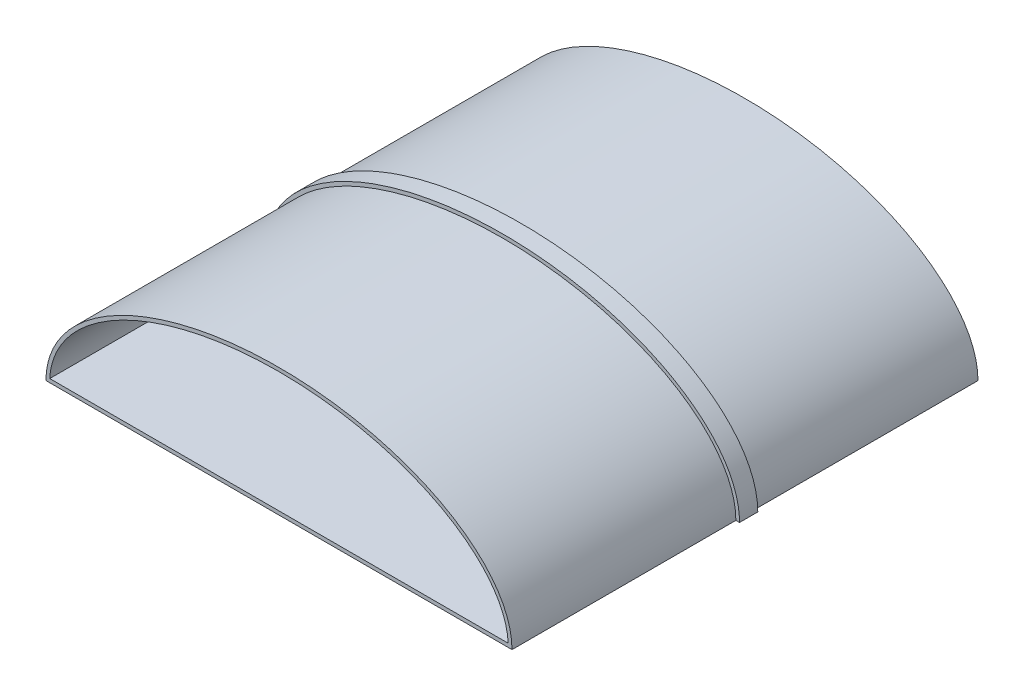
ISO-10303-21;
HEADER;
FILE_DESCRIPTION(('STEP AP214'),'2;1');
FILE_NAME('part.step','',(''),(''),'','','');
FILE_SCHEMA(('AUTOMOTIVE_DESIGN { 1 0 10303 214 1 1 1 1 }'));
ENDSEC;
DATA;
#1=APPLICATION_CONTEXT('core data for automotive mechanical design processes');
#2=APPLICATION_PROTOCOL_DEFINITION('international standard','automotive_design',2000,#1);
#3=PRODUCT_CONTEXT('',#1,'mechanical');
#4=PRODUCT('Part','Part','',(#3));
#5=PRODUCT_RELATED_PRODUCT_CATEGORY('part','',(#4));
#6=PRODUCT_DEFINITION_FORMATION('','',#4);
#7=PRODUCT_DEFINITION_CONTEXT('part definition',#1,'design');
#8=PRODUCT_DEFINITION('design','',#6,#7);
#9=PRODUCT_DEFINITION_SHAPE('','',#8);
#10=(LENGTH_UNIT() NAMED_UNIT(*) SI_UNIT(.MILLI.,.METRE.));
#11=(NAMED_UNIT(*) PLANE_ANGLE_UNIT() SI_UNIT($,.RADIAN.));
#12=(NAMED_UNIT(*) SI_UNIT($,.STERADIAN.) SOLID_ANGLE_UNIT());
#13=UNCERTAINTY_MEASURE_WITH_UNIT(LENGTH_MEASURE(1.E-05),#10,'distance_accuracy_value','');
#14=(GEOMETRIC_REPRESENTATION_CONTEXT(3) GLOBAL_UNCERTAINTY_ASSIGNED_CONTEXT((#13)) GLOBAL_UNIT_ASSIGNED_CONTEXT((#10,
#11,#12)) REPRESENTATION_CONTEXT('',''));
#15=CARTESIAN_POINT('',(0.,0.,0.));
#16=DIRECTION('',(0.,0.,1.));
#17=DIRECTION('',(1.,0.,0.));
#18=AXIS2_PLACEMENT_3D('',#15,#16,#17);
#19=CARTESIAN_POINT('',(127.5,0.,255.));
#20=DIRECTION('',(0.,0.,1.));
#21=DIRECTION('',(-1.,0.,0.));
#22=AXIS2_PLACEMENT_3D('',#19,#20,#21);
#23=ELLIPSE('',#22,127.5,70.);
#24=DIRECTION('',(0.,0.,-1.));
#25=VECTOR('',#24,1.);
#26=SURFACE_OF_LINEAR_EXTRUSION('',#23,#25);
#27=CARTESIAN_POINT('',(127.5,0.,132.5));
#28=DIRECTION('',(0.,0.,1.));
#29=DIRECTION('',(-1.,0.,0.));
#30=AXIS2_PLACEMENT_3D('',#27,#28,#29);
#31=ELLIPSE('',#30,127.5,70.);
#32=CARTESIAN_POINT('',(255.,0.,132.5));
#33=VERTEX_POINT('',#32);
#34=CARTESIAN_POINT('',(252.550123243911,13.6563225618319,132.5));
#35=VERTEX_POINT('',#34);
#36=EDGE_CURVE('E214',#33,#35,#31,.T.);
#37=ORIENTED_EDGE('',*,*,#36,.T.);
#38=CARTESIAN_POINT('',(127.5,0.,132.5));
#39=DIRECTION('',(0.,0.,1.));
#40=DIRECTION('',(-1.,0.,0.));
#41=AXIS2_PLACEMENT_3D('',#38,#39,#40);
#42=ELLIPSE('',#41,127.5,70.);
#43=CARTESIAN_POINT('',(127.500000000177,70.,132.5));
#44=VERTEX_POINT('',#43);
#45=EDGE_CURVE('E280',#44,#35,#42,.F.);
#46=ORIENTED_EDGE('',*,*,#45,.F.);
#47=CARTESIAN_POINT('',(127.5,0.,132.5));
#48=DIRECTION('',(0.,0.,1.));
#49=DIRECTION('',(-1.,0.,0.));
#50=AXIS2_PLACEMENT_3D('',#47,#48,#49);
#51=ELLIPSE('',#50,127.5,70.);
#52=CARTESIAN_POINT('',(37.3438853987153,49.4974746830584,132.5));
#53=VERTEX_POINT('',#52);
#54=EDGE_CURVE('E283',#53,#44,#51,.F.);
#55=ORIENTED_EDGE('',*,*,#54,.F.);
#56=CARTESIAN_POINT('',(127.5,0.,132.5));
#57=DIRECTION('',(0.,0.,1.));
#58=DIRECTION('',(-1.,0.,0.));
#59=AXIS2_PLACEMENT_3D('',#56,#57,#58);
#60=ELLIPSE('',#59,127.5,70.);
#61=CARTESIAN_POINT('',(2.44987674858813,13.656322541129,132.5));
#62=VERTEX_POINT('',#61);
#63=EDGE_CURVE('E285',#62,#53,#60,.F.);
#64=ORIENTED_EDGE('',*,*,#63,.F.);
#65=CARTESIAN_POINT('',(127.5,0.,132.5));
#66=DIRECTION('',(0.,0.,1.));
#67=DIRECTION('',(-1.,0.,0.));
#68=AXIS2_PLACEMENT_3D('',#65,#66,#67);
#69=ELLIPSE('',#68,127.5,70.);
#70=CARTESIAN_POINT('',(0.,0.,132.5));
#71=VERTEX_POINT('',#70);
#72=EDGE_CURVE('E287',#71,#62,#69,.F.);
#73=ORIENTED_EDGE('',*,*,#72,.F.);
#74=DIRECTION('',(0.,0.,-1.));
#75=VECTOR('',#74,1.);
#76=CARTESIAN_POINT('',(0.,0.,255.));
#77=LINE('',#76,#75);
#78=CARTESIAN_POINT('',(0.,0.,255.));
#79=VERTEX_POINT('',#78);
#80=EDGE_CURVE('E212',#79,#71,#77,.T.);
#81=ORIENTED_EDGE('',*,*,#80,.F.);
#82=CARTESIAN_POINT('',(255.,0.,255.));
#83=VERTEX_POINT('',#82);
#84=EDGE_CURVE('E438',#83,#79,#23,.T.);
#85=ORIENTED_EDGE('',*,*,#84,.F.);
#86=DIRECTION('',(0.,0.,-1.));
#87=VECTOR('',#86,1.);
#88=CARTESIAN_POINT('',(255.,0.,255.));
#89=LINE('',#88,#87);
#90=EDGE_CURVE('E461',#83,#33,#89,.T.);
#91=ORIENTED_EDGE('',*,*,#90,.T.);
#92=EDGE_LOOP('',(#37,#46,#55,#64,#73,#81,#85,#91));
#93=FACE_BOUND('',#92,.T.);
#94=ADVANCED_FACE('F39',(#93),#26,.F.);
#95=CARTESIAN_POINT('',(0.,0.,255.));
#96=DIRECTION('',(0.,1.,0.));
#97=DIRECTION('',(0.,0.,1.));
#98=AXIS2_PLACEMENT_3D('',#95,#96,#97);
#99=PLANE('',#98);
#100=DIRECTION('',(1.,0.,0.));
#101=VECTOR('',#100,1.);
#102=CARTESIAN_POINT('',(0.,0.,0.));
#103=LINE('',#102,#101);
#104=CARTESIAN_POINT('',(0.,0.,0.));
#105=VERTEX_POINT('',#104);
#106=CARTESIAN_POINT('',(255.,0.,0.));
#107=VERTEX_POINT('',#106);
#108=EDGE_CURVE('E444',#105,#107,#103,.T.);
#109=ORIENTED_EDGE('',*,*,#108,.T.);
#110=CARTESIAN_POINT('',(255.,0.,122.5));
#111=VERTEX_POINT('',#110);
#112=EDGE_CURVE('E447',#111,#107,#89,.T.);
#113=ORIENTED_EDGE('',*,*,#112,.F.);
#114=DIRECTION('',(-1.,0.,0.));
#115=VECTOR('',#114,1.);
#116=CARTESIAN_POINT('',(257.,0.,122.5));
#117=LINE('',#116,#115);
#118=CARTESIAN_POINT('',(257.,0.,122.5));
#119=VERTEX_POINT('',#118);
#120=EDGE_CURVE('E193',#119,#111,#117,.T.);
#121=ORIENTED_EDGE('',*,*,#120,.F.);
#122=DIRECTION('',(0.,0.,1.));
#123=VECTOR('',#122,1.);
#124=CARTESIAN_POINT('',(257.,0.,122.5));
#125=LINE('',#124,#123);
#126=CARTESIAN_POINT('',(257.,0.,132.5));
#127=VERTEX_POINT('',#126);
#128=EDGE_CURVE('E192',#119,#127,#125,.T.);
#129=ORIENTED_EDGE('',*,*,#128,.T.);
#130=DIRECTION('',(-1.,0.,0.));
#131=VECTOR('',#130,1.);
#132=CARTESIAN_POINT('',(257.,0.,132.5));
#133=LINE('',#132,#131);
#134=EDGE_CURVE('E203',#127,#33,#133,.T.);
#135=ORIENTED_EDGE('',*,*,#134,.T.);
#136=ORIENTED_EDGE('',*,*,#90,.F.);
#137=DIRECTION('',(1.,0.,0.));
#138=VECTOR('',#137,1.);
#139=CARTESIAN_POINT('',(0.,0.,255.));
#140=LINE('',#139,#138);
#141=EDGE_CURVE('E443',#79,#83,#140,.T.);
#142=ORIENTED_EDGE('',*,*,#141,.F.);
#143=ORIENTED_EDGE('',*,*,#80,.T.);
#144=DIRECTION('',(-1.,0.,0.));
#145=VECTOR('',#144,1.);
#146=CARTESIAN_POINT('',(0.,0.,132.5));
#147=LINE('',#146,#145);
#148=CARTESIAN_POINT('',(-2.,0.,132.5));
#149=VERTEX_POINT('',#148);
#150=EDGE_CURVE('E200',#71,#149,#147,.T.);
#151=ORIENTED_EDGE('',*,*,#150,.T.);
#152=DIRECTION('',(0.,0.,1.));
#153=VECTOR('',#152,1.);
#154=CARTESIAN_POINT('',(-2.,0.,122.5));
#155=LINE('',#154,#153);
#156=CARTESIAN_POINT('',(-2.,0.,122.5));
#157=VERTEX_POINT('',#156);
#158=EDGE_CURVE('E179',#157,#149,#155,.T.);
#159=ORIENTED_EDGE('',*,*,#158,.F.);
#160=DIRECTION('',(-1.,0.,0.));
#161=VECTOR('',#160,1.);
#162=CARTESIAN_POINT('',(0.,0.,122.5));
#163=LINE('',#162,#161);
#164=CARTESIAN_POINT('',(0.,0.,122.5));
#165=VERTEX_POINT('',#164);
#166=EDGE_CURVE('E537',#165,#157,#163,.T.);
#167=ORIENTED_EDGE('',*,*,#166,.F.);
#168=EDGE_CURVE('E464',#165,#105,#77,.T.);
#169=ORIENTED_EDGE('',*,*,#168,.T.);
#170=EDGE_LOOP('',(#109,#113,#121,#129,#135,#136,#142,#143,#151,#159,#167,#169));
#171=FACE_BOUND('',#170,.T.);
#172=DIRECTION('',(0.,0.,-1.));
#173=VECTOR('',#172,1.);
#174=CARTESIAN_POINT('',(30.,0.,225.));
#175=LINE('',#174,#173);
#176=CARTESIAN_POINT('',(30.,0.,225.));
#177=VERTEX_POINT('',#176);
#178=CARTESIAN_POINT('',(30.,0.,30.));
#179=VERTEX_POINT('',#178);
#180=EDGE_CURVE('E384',#177,#179,#175,.T.);
#181=ORIENTED_EDGE('',*,*,#180,.F.);
#182=DIRECTION('',(-1.,0.,0.));
#183=VECTOR('',#182,1.);
#184=CARTESIAN_POINT('',(225.,0.,225.));
#185=LINE('',#184,#183);
#186=CARTESIAN_POINT('',(225.,0.,225.));
#187=VERTEX_POINT('',#186);
#188=EDGE_CURVE('E399',#187,#177,#185,.T.);
#189=ORIENTED_EDGE('',*,*,#188,.F.);
#190=DIRECTION('',(0.,0.,1.));
#191=VECTOR('',#190,1.);
#192=CARTESIAN_POINT('',(225.,0.,30.));
#193=LINE('',#192,#191);
#194=CARTESIAN_POINT('',(225.,0.,30.));
#195=VERTEX_POINT('',#194);
#196=EDGE_CURVE('E416',#195,#187,#193,.T.);
#197=ORIENTED_EDGE('',*,*,#196,.F.);
#198=DIRECTION('',(1.,0.,0.));
#199=VECTOR('',#198,1.);
#200=CARTESIAN_POINT('',(30.,0.,30.));
#201=LINE('',#200,#199);
#202=EDGE_CURVE('E412',#179,#195,#201,.T.);
#203=ORIENTED_EDGE('',*,*,#202,.F.);
#204=EDGE_LOOP('',(#181,#189,#197,#203));
#205=FACE_BOUND('',#204,.T.);
#206=ADVANCED_FACE('F209',(#171,#205),#99,.F.);
#207=CARTESIAN_POINT('',(127.5,0.,122.5));
#208=DIRECTION('',(0.,0.,-1.));
#209=DIRECTION('',(-1.,0.,0.));
#210=AXIS2_PLACEMENT_3D('',#207,#208,#209);
#211=ELLIPSE('',#210,127.5,70.);
#212=CARTESIAN_POINT('',(127.500000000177,70.,122.5));
#213=VERTEX_POINT('',#212);
#214=CARTESIAN_POINT('',(252.550123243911,13.6563225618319,122.5));
#215=VERTEX_POINT('',#214);
#216=EDGE_CURVE('E11',#213,#215,#211,.T.);
#217=ORIENTED_EDGE('',*,*,#216,.T.);
#218=CARTESIAN_POINT('',(127.5,0.,122.5));
#219=DIRECTION('',(0.,0.,-1.));
#220=DIRECTION('',(-1.,0.,0.));
#221=AXIS2_PLACEMENT_3D('',#218,#219,#220);
#222=ELLIPSE('',#221,127.5,70.);
#223=EDGE_CURVE('E540',#111,#215,#222,.F.);
#224=ORIENTED_EDGE('',*,*,#223,.F.);
#225=ORIENTED_EDGE('',*,*,#112,.T.);
#226=CARTESIAN_POINT('',(127.5,0.,0.));
#227=DIRECTION('',(0.,0.,1.));
#228=DIRECTION('',(-1.,0.,0.));
#229=AXIS2_PLACEMENT_3D('',#226,#227,#228);
#230=ELLIPSE('',#229,127.5,70.);
#231=EDGE_CURVE('E437',#107,#105,#230,.T.);
#232=ORIENTED_EDGE('',*,*,#231,.T.);
#233=ORIENTED_EDGE('',*,*,#168,.F.);
#234=CARTESIAN_POINT('',(127.5,0.,122.5));
#235=DIRECTION('',(0.,0.,-1.));
#236=DIRECTION('',(-1.,0.,0.));
#237=AXIS2_PLACEMENT_3D('',#234,#235,#236);
#238=ELLIPSE('',#237,127.5,70.);
#239=CARTESIAN_POINT('',(2.449876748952,13.6563225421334,122.5));
#240=VERTEX_POINT('',#239);
#241=EDGE_CURVE('E309',#165,#240,#238,.T.);
#242=ORIENTED_EDGE('',*,*,#241,.T.);
#243=CARTESIAN_POINT('',(127.5,0.,122.5));
#244=DIRECTION('',(0.,0.,-1.));
#245=DIRECTION('',(-1.,0.,0.));
#246=AXIS2_PLACEMENT_3D('',#243,#244,#245);
#247=ELLIPSE('',#246,127.5,70.);
#248=CARTESIAN_POINT('',(37.3438853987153,49.4974746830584,122.5));
#249=VERTEX_POINT('',#248);
#250=EDGE_CURVE('E307',#240,#249,#247,.T.);
#251=ORIENTED_EDGE('',*,*,#250,.T.);
#252=CARTESIAN_POINT('',(127.5,0.,122.5));
#253=DIRECTION('',(0.,0.,-1.));
#254=DIRECTION('',(-1.,0.,0.));
#255=AXIS2_PLACEMENT_3D('',#252,#253,#254);
#256=ELLIPSE('',#255,127.5,70.);
#257=EDGE_CURVE('E52',#249,#213,#256,.T.);
#258=ORIENTED_EDGE('',*,*,#257,.T.);
#259=EDGE_LOOP('',(#217,#224,#225,#232,#233,#242,#251,#258));
#260=FACE_BOUND('',#259,.T.);
#261=ADVANCED_FACE('F41',(#260),#26,.F.);
#262=CARTESIAN_POINT('',(127.5,0.,255.));
#263=DIRECTION('',(0.,0.,1.));
#264=DIRECTION('',(1.,0.,0.));
#265=AXIS2_PLACEMENT_3D('',#262,#263,#264);
#266=PLANE('',#265);
#267=CARTESIAN_POINT('',(252.94509137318,2.00000000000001,255.));
#268=CARTESIAN_POINT('',(252.766662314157,5.24891875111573,255.));
#269=CARTESIAN_POINT('',(252.16192186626,8.39524352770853,255.));
#270=CARTESIAN_POINT('',(250.94442723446,12.2170705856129,255.));
#271=CARTESIAN_POINT('',(250.677682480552,12.975841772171,255.));
#272=CARTESIAN_POINT('',(250.098875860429,14.4824783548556,255.));
#273=CARTESIAN_POINT('',(249.785732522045,15.2326564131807,255.));
#274=CARTESIAN_POINT('',(248.788722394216,17.4478719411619,255.));
#275=CARTESIAN_POINT('',(248.049233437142,18.8756767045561,255.));
#276=CARTESIAN_POINT('',(245.635710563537,23.0313256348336,255.));
#277=CARTESIAN_POINT('',(243.768182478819,25.6324274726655,255.));
#278=CARTESIAN_POINT('',(241.172981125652,28.7129815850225,255.));
#279=CARTESIAN_POINT('',(240.639900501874,29.3214080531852,255.));
#280=CARTESIAN_POINT('',(239.552603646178,30.5172192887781,255.));
#281=CARTESIAN_POINT('',(238.999610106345,31.1033481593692,255.));
#282=CARTESIAN_POINT('',(237.314559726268,32.828881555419,255.));
#283=CARTESIAN_POINT('',(236.156504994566,33.9355234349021,255.));
#284=CARTESIAN_POINT('',(232.590839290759,37.1401385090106,255.));
#285=CARTESIAN_POINT('',(230.092357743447,39.1235962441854,255.));
#286=CARTESIAN_POINT('',(224.897498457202,42.8411221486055,255.));
#287=CARTESIAN_POINT('',(222.199411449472,44.5755609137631,255.));
#288=CARTESIAN_POINT('',(216.637943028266,47.8258852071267,255.));
#289=CARTESIAN_POINT('',(213.808265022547,49.3223559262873,255.));
#290=CARTESIAN_POINT('',(208.067277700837,52.1006583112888,255.));
#291=CARTESIAN_POINT('',(205.155867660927,53.3822251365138,255.));
#292=CARTESIAN_POINT('',(196.314782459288,56.9459638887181,255.));
#293=CARTESIAN_POINT('',(190.279228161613,58.9497402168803,255.));
#294=CARTESIAN_POINT('',(182.58762224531,61.0675142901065,255.));
#295=CARTESIAN_POINT('',(181.041857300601,61.4714966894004,255.));
#296=CARTESIAN_POINT('',(177.935881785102,62.2414785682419,255.));
#297=CARTESIAN_POINT('',(176.373813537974,62.6078796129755,255.));
#298=CARTESIAN_POINT('',(171.680855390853,63.6483582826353,255.));
#299=CARTESIAN_POINT('',(168.547945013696,64.2630410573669,255.));
#300=CARTESIAN_POINT('',(159.13735887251,65.8879247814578,255.));
#301=CARTESIAN_POINT('',(152.847901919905,66.6803258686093,255.));
#302=CARTESIAN_POINT('',(140.240328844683,67.7353034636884,255.));
#303=CARTESIAN_POINT('',(133.92219254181,67.9975068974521,255.));
#304=CARTESIAN_POINT('',(121.257821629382,68.002457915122,255.));
#305=CARTESIAN_POINT('',(114.911591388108,67.7452862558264,255.));
#306=CARTESIAN_POINT('',(106.960385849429,67.0833313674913,255.));
#307=CARTESIAN_POINT('',(105.369218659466,66.9338198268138,255.));
#308=CARTESIAN_POINT('',(102.184988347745,66.5997464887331,255.));
#309=CARTESIAN_POINT('',(100.593373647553,66.4152966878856,255.));
#310=CARTESIAN_POINT('',(95.8361463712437,65.8109134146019,255.));
#311=CARTESIAN_POINT('',(92.681992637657,65.3394105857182,255.));
#312=CARTESIAN_POINT('',(83.2731348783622,63.7127889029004,255.));
#313=CARTESIAN_POINT('',(77.0715445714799,62.3474947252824,255.));
#314=CARTESIAN_POINT('',(64.8287395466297,58.9822870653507,255.));
#315=CARTESIAN_POINT('',(58.7870312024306,56.9843269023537,255.));
#316=CARTESIAN_POINT('',(51.359523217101,53.9937157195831,255.));
#317=CARTESIAN_POINT('',(49.8782183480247,53.3696775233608,255.));
#318=CARTESIAN_POINT('',(46.9402248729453,52.0726044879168,255.));
#319=CARTESIAN_POINT('',(45.484806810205,51.4002253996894,255.));
#320=CARTESIAN_POINT('',(41.1617259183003,49.3072808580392,255.));
#321=CARTESIAN_POINT('',(38.3369897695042,47.8113411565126,255.));
#322=CARTESIAN_POINT('',(32.8200164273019,44.586809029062,255.));
#323=CARTESIAN_POINT('',(30.1275870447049,42.8585540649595,255.));
#324=CARTESIAN_POINT('',(26.209096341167,40.055196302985,255.));
#325=CARTESIAN_POINT('',(24.9208400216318,39.0834282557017,255.));
#326=CARTESIAN_POINT('',(22.4129648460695,37.0797449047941,255.));
#327=CARTESIAN_POINT('',(21.1908955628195,36.0462708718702,255.));
#328=CARTESIAN_POINT('',(17.6292216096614,32.8420888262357,255.));
#329=CARTESIAN_POINT('',(15.3928624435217,30.5688997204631,255.));
#330=CARTESIAN_POINT('',(12.2989147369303,26.9004543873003,255.));
#331=CARTESIAN_POINT('',(11.3112987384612,25.6342629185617,255.));
#332=CARTESIAN_POINT('',(9.90581977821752,23.6595929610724,255.));
#333=CARTESIAN_POINT('',(9.45176010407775,22.9910997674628,255.));
#334=CARTESIAN_POINT('',(8.57842601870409,21.6393141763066,255.));
#335=CARTESIAN_POINT('',(8.15844409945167,20.955037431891,255.));
#336=CARTESIAN_POINT('',(6.14578655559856,17.489811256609,255.));
#337=CARTESIAN_POINT('',(4.81160458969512,14.57897380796,255.));
#338=CARTESIAN_POINT('',(3.57844440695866,10.7220654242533,255.));
#339=CARTESIAN_POINT('',(3.35507503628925,9.943406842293,255.));
#340=CARTESIAN_POINT('',(2.95850531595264,8.37966181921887,255.));
#341=CARTESIAN_POINT('',(2.78488553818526,7.59328459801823,255.));
#342=CARTESIAN_POINT('',(2.33976516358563,5.22032034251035,255.));
#343=CARTESIAN_POINT('',(2.14387409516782,3.61992435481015,255.));
#344=CARTESIAN_POINT('',(2.05490862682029,2.0000000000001,255.));
#345=B_SPLINE_CURVE_WITH_KNOTS('',3,(#267,#268,#269,#270,#271,#272,#273,#274,#275,#276,#277,
#278,#279,#280,#281,#282,#283,#284,#285,#286,#287,#288,#289,#290,#291,#292,#293,#294,#295,#296,
#297,#298,#299,#300,#301,#302,#303,#304,#305,#306,#307,#308,#309,#310,#311,#312,#313,#314,#315,
#316,#317,#318,#319,#320,#321,#322,#323,#324,#325,#326,#327,#328,#329,#330,#331,#332,#333,#334,
#335,#336,#337,#338,#339,#340,#341,#342,#343,#344),.UNSPECIFIED.,.F.,.F.,(4,2,2,2,2,2,2,2,2,2,2,
2,2,2,2,2,2,2,2,2,2,2,2,2,2,2,2,2,2,2,2,2,2,2,2,2,2,2,4),(0.,0.0312499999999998,
0.0390624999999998,0.0468749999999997,0.0624999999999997,0.0937499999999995,0.101562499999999,
0.109374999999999,0.124999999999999,0.156249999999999,0.187499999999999,0.218749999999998,
0.249999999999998,0.312499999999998,0.328124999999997,0.343749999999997,0.374999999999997,
0.437499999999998,0.499999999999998,0.562499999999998,0.578124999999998,0.593749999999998,
0.624999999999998,0.687499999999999,0.749999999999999,0.765624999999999,0.781249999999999,
0.812499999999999,0.843749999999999,0.859374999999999,0.874999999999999,0.906249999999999,
0.921874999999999,0.929687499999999,0.937499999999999,0.96875,0.9765625,0.984375,1.),.UNSPECIFIED.);
#346=CARTESIAN_POINT('',(252.94509137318,2.00000000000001,255.));
#347=VERTEX_POINT('',#346);
#348=CARTESIAN_POINT('',(2.05490862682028,2.00000000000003,255.));
#349=VERTEX_POINT('',#348);
#350=EDGE_CURVE('E345',#347,#349,#345,.T.);
#351=ORIENTED_EDGE('',*,*,#350,.F.);
#352=DIRECTION('',(1.,0.,0.));
#353=VECTOR('',#352,1.);
#354=CARTESIAN_POINT('',(2.05490862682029,2.00000000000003,255.));
#355=LINE('',#354,#353);
#356=EDGE_CURVE('E335',#349,#347,#355,.T.);
#357=ORIENTED_EDGE('',*,*,#356,.F.);
#358=EDGE_LOOP('',(#351,#357));
#359=FACE_BOUND('',#358,.T.);
#360=ORIENTED_EDGE('',*,*,#84,.T.);
#361=ORIENTED_EDGE('',*,*,#141,.T.);
#362=EDGE_LOOP('',(#360,#361));
#363=FACE_BOUND('',#362,.T.);
#364=ADVANCED_FACE('F475',(#359,#363),#266,.T.);
#365=CARTESIAN_POINT('',(127.5,0.,0.));
#366=DIRECTION('',(0.,0.,1.));
#367=DIRECTION('',(1.,0.,0.));
#368=AXIS2_PLACEMENT_3D('',#365,#366,#367);
#369=PLANE('',#368);
#370=DIRECTION('',(1.,0.,0.));
#371=VECTOR('',#370,1.);
#372=CARTESIAN_POINT('',(2.05490862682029,2.00000000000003,0.));
#373=LINE('',#372,#371);
#374=CARTESIAN_POINT('',(2.05490862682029,2.00000000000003,0.));
#375=VERTEX_POINT('',#374);
#376=CARTESIAN_POINT('',(252.94509137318,2.00000000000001,0.));
#377=VERTEX_POINT('',#376);
#378=EDGE_CURVE('E503',#375,#377,#373,.T.);
#379=ORIENTED_EDGE('',*,*,#378,.T.);
#380=CARTESIAN_POINT('',(2.05490862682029,2.0000000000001,0.));
#381=CARTESIAN_POINT('',(2.14387409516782,3.61992435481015,0.));
#382=CARTESIAN_POINT('',(2.33976516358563,5.22032034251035,0.));
#383=CARTESIAN_POINT('',(2.78488553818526,7.59328459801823,0.));
#384=CARTESIAN_POINT('',(2.95850531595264,8.37966181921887,0.));
#385=CARTESIAN_POINT('',(3.35507503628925,9.943406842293,0.));
#386=CARTESIAN_POINT('',(3.57844440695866,10.7220654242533,0.));
#387=CARTESIAN_POINT('',(4.81160458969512,14.57897380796,0.));
#388=CARTESIAN_POINT('',(6.14578655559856,17.489811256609,0.));
#389=CARTESIAN_POINT('',(8.15844409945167,20.955037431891,0.));
#390=CARTESIAN_POINT('',(8.57842601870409,21.6393141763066,0.));
#391=CARTESIAN_POINT('',(9.45176010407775,22.9910997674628,0.));
#392=CARTESIAN_POINT('',(9.90581977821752,23.6595929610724,0.));
#393=CARTESIAN_POINT('',(11.3112987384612,25.6342629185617,0.));
#394=CARTESIAN_POINT('',(12.2989147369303,26.9004543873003,0.));
#395=CARTESIAN_POINT('',(15.3928624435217,30.5688997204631,0.));
#396=CARTESIAN_POINT('',(17.6292216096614,32.8420888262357,0.));
#397=CARTESIAN_POINT('',(21.1908955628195,36.0462708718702,0.));
#398=CARTESIAN_POINT('',(22.4129648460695,37.0797449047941,0.));
#399=CARTESIAN_POINT('',(24.9208400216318,39.0834282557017,0.));
#400=CARTESIAN_POINT('',(26.209096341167,40.055196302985,0.));
#401=CARTESIAN_POINT('',(30.1275870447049,42.8585540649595,0.));
#402=CARTESIAN_POINT('',(32.8200164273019,44.586809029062,0.));
#403=CARTESIAN_POINT('',(38.3369897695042,47.8113411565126,0.));
#404=CARTESIAN_POINT('',(41.1617259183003,49.3072808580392,0.));
#405=CARTESIAN_POINT('',(45.484806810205,51.4002253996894,0.));
#406=CARTESIAN_POINT('',(46.9402248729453,52.0726044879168,0.));
#407=CARTESIAN_POINT('',(49.8782183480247,53.3696775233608,0.));
#408=CARTESIAN_POINT('',(51.359523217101,53.9937157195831,0.));
#409=CARTESIAN_POINT('',(58.7870312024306,56.9843269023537,0.));
#410=CARTESIAN_POINT('',(64.8287395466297,58.9822870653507,0.));
#411=CARTESIAN_POINT('',(77.0715445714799,62.3474947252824,0.));
#412=CARTESIAN_POINT('',(83.2731348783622,63.7127889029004,0.));
#413=CARTESIAN_POINT('',(92.681992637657,65.3394105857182,0.));
#414=CARTESIAN_POINT('',(95.8361463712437,65.8109134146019,0.));
#415=CARTESIAN_POINT('',(100.593373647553,66.4152966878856,0.));
#416=CARTESIAN_POINT('',(102.184988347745,66.5997464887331,0.));
#417=CARTESIAN_POINT('',(105.369218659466,66.9338198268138,0.));
#418=CARTESIAN_POINT('',(106.960385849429,67.0833313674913,0.));
#419=CARTESIAN_POINT('',(114.911591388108,67.7452862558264,0.));
#420=CARTESIAN_POINT('',(121.257821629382,68.002457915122,0.));
#421=CARTESIAN_POINT('',(133.92219254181,67.9975068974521,0.));
#422=CARTESIAN_POINT('',(140.240328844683,67.7353034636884,0.));
#423=CARTESIAN_POINT('',(152.847901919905,66.6803258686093,0.));
#424=CARTESIAN_POINT('',(159.13735887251,65.8879247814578,0.));
#425=CARTESIAN_POINT('',(168.547945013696,64.2630410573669,0.));
#426=CARTESIAN_POINT('',(171.680855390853,63.6483582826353,0.));
#427=CARTESIAN_POINT('',(176.373813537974,62.6078796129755,0.));
#428=CARTESIAN_POINT('',(177.935881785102,62.2414785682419,0.));
#429=CARTESIAN_POINT('',(181.041857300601,61.4714966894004,0.));
#430=CARTESIAN_POINT('',(182.58762224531,61.0675142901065,0.));
#431=CARTESIAN_POINT('',(190.279228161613,58.9497402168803,0.));
#432=CARTESIAN_POINT('',(196.314782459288,56.9459638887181,0.));
#433=CARTESIAN_POINT('',(205.155867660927,53.3822251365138,0.));
#434=CARTESIAN_POINT('',(208.067277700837,52.1006583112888,0.));
#435=CARTESIAN_POINT('',(213.808265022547,49.3223559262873,0.));
#436=CARTESIAN_POINT('',(216.637943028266,47.8258852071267,0.));
#437=CARTESIAN_POINT('',(222.199411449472,44.5755609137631,0.));
#438=CARTESIAN_POINT('',(224.897498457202,42.8411221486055,0.));
#439=CARTESIAN_POINT('',(230.092357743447,39.1235962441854,0.));
#440=CARTESIAN_POINT('',(232.590839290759,37.1401385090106,0.));
#441=CARTESIAN_POINT('',(236.156504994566,33.9355234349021,0.));
#442=CARTESIAN_POINT('',(237.314559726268,32.828881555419,0.));
#443=CARTESIAN_POINT('',(238.999610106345,31.1033481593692,0.));
#444=CARTESIAN_POINT('',(239.552603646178,30.5172192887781,0.));
#445=CARTESIAN_POINT('',(240.639900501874,29.3214080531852,0.));
#446=CARTESIAN_POINT('',(241.172981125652,28.7129815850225,0.));
#447=CARTESIAN_POINT('',(243.768182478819,25.6324274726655,0.));
#448=CARTESIAN_POINT('',(245.635710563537,23.0313256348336,0.));
#449=CARTESIAN_POINT('',(248.049233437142,18.8756767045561,0.));
#450=CARTESIAN_POINT('',(248.788722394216,17.4478719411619,0.));
#451=CARTESIAN_POINT('',(249.785732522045,15.2326564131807,0.));
#452=CARTESIAN_POINT('',(250.098875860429,14.4824783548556,0.));
#453=CARTESIAN_POINT('',(250.677682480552,12.975841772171,0.));
#454=CARTESIAN_POINT('',(250.94442723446,12.2170705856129,0.));
#455=CARTESIAN_POINT('',(252.16192186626,8.39524352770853,0.));
#456=CARTESIAN_POINT('',(252.766662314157,5.24891875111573,0.));
#457=CARTESIAN_POINT('',(252.94509137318,2.00000000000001,0.));
#458=B_SPLINE_CURVE_WITH_KNOTS('',3,(#380,#381,#382,#383,#384,#385,#386,#387,#388,#389,#390,
#391,#392,#393,#394,#395,#396,#397,#398,#399,#400,#401,#402,#403,#404,#405,#406,#407,#408,#409,
#410,#411,#412,#413,#414,#415,#416,#417,#418,#419,#420,#421,#422,#423,#424,#425,#426,#427,#428,
#429,#430,#431,#432,#433,#434,#435,#436,#437,#438,#439,#440,#441,#442,#443,#444,#445,#446,#447,
#448,#449,#450,#451,#452,#453,#454,#455,#456,#457),.UNSPECIFIED.,.F.,.F.,(4,2,2,2,2,2,2,2,2,2,2,
2,2,2,2,2,2,2,2,2,2,2,2,2,2,2,2,2,2,2,2,2,2,2,2,2,2,2,4),(0.,0.0156250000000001,
0.0234375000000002,0.0312500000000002,0.0625000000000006,0.0703125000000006,0.0781250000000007,
0.0937500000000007,0.125000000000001,0.140625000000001,0.156250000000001,0.187500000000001,
0.218750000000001,0.234375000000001,0.250000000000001,0.312500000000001,0.375000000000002,
0.406250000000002,0.421875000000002,0.437500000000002,0.500000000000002,0.562500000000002,
0.625000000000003,0.656250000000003,0.671875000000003,0.687500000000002,0.750000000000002,
0.781250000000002,0.812500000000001,0.843750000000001,0.875000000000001,0.890625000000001,
0.898437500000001,0.906250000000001,0.9375,0.953125,0.9609375,0.96875,1.),.UNSPECIFIED.);
#459=EDGE_CURVE('E344',#377,#375,#458,.F.);
#460=ORIENTED_EDGE('',*,*,#459,.T.);
#461=EDGE_LOOP('',(#379,#460));
#462=FACE_BOUND('',#461,.T.);
#463=ORIENTED_EDGE('',*,*,#231,.F.);
#464=ORIENTED_EDGE('',*,*,#108,.F.);
#465=EDGE_LOOP('',(#463,#464));
#466=FACE_BOUND('',#465,.T.);
#467=ADVANCED_FACE('F485',(#462,#466),#369,.F.);
#468=CARTESIAN_POINT('',(30.,-10.,225.));
#469=DIRECTION('',(1.,0.,0.));
#470=DIRECTION('',(0.,0.,-1.));
#471=AXIS2_PLACEMENT_3D('',#468,#469,#470);
#472=PLANE('',#471);
#473=ORIENTED_EDGE('',*,*,#180,.T.);
#474=DIRECTION('',(0.,1.,0.));
#475=VECTOR('',#474,1.);
#476=CARTESIAN_POINT('',(30.,-10.,30.));
#477=LINE('',#476,#475);
#478=CARTESIAN_POINT('',(30.,-10.,30.));
#479=VERTEX_POINT('',#478);
#480=EDGE_CURVE('E434',#479,#179,#477,.T.);
#481=ORIENTED_EDGE('',*,*,#480,.F.);
#482=DIRECTION('',(0.,0.,-1.));
#483=VECTOR('',#482,1.);
#484=CARTESIAN_POINT('',(30.,-10.,225.));
#485=LINE('',#484,#483);
#486=CARTESIAN_POINT('',(30.,-10.,225.));
#487=VERTEX_POINT('',#486);
#488=EDGE_CURVE('E394',#487,#479,#485,.T.);
#489=ORIENTED_EDGE('',*,*,#488,.F.);
#490=DIRECTION('',(0.,1.,0.));
#491=VECTOR('',#490,1.);
#492=CARTESIAN_POINT('',(30.,-10.,225.));
#493=LINE('',#492,#491);
#494=EDGE_CURVE('E408',#487,#177,#493,.T.);
#495=ORIENTED_EDGE('',*,*,#494,.T.);
#496=EDGE_LOOP('',(#473,#481,#489,#495));
#497=FACE_BOUND('',#496,.T.);
#498=ADVANCED_FACE('F487',(#497),#472,.F.);
#499=CARTESIAN_POINT('',(30.,-10.,30.));
#500=DIRECTION('',(0.,0.,1.));
#501=DIRECTION('',(1.,0.,0.));
#502=AXIS2_PLACEMENT_3D('',#499,#500,#501);
#503=PLANE('',#502);
#504=ORIENTED_EDGE('',*,*,#202,.T.);
#505=DIRECTION('',(0.,1.,0.));
#506=VECTOR('',#505,1.);
#507=CARTESIAN_POINT('',(225.,-10.,30.));
#508=LINE('',#507,#506);
#509=CARTESIAN_POINT('',(225.,-10.,30.));
#510=VERTEX_POINT('',#509);
#511=EDGE_CURVE('E430',#510,#195,#508,.T.);
#512=ORIENTED_EDGE('',*,*,#511,.F.);
#513=DIRECTION('',(1.,0.,0.));
#514=VECTOR('',#513,1.);
#515=CARTESIAN_POINT('',(30.,-10.,30.));
#516=LINE('',#515,#514);
#517=EDGE_CURVE('E398',#479,#510,#516,.T.);
#518=ORIENTED_EDGE('',*,*,#517,.F.);
#519=ORIENTED_EDGE('',*,*,#480,.T.);
#520=EDGE_LOOP('',(#504,#512,#518,#519));
#521=FACE_BOUND('',#520,.T.);
#522=ADVANCED_FACE('F665',(#521),#503,.F.);
#523=CARTESIAN_POINT('',(225.,-10.,30.));
#524=DIRECTION('',(-1.,0.,0.));
#525=DIRECTION('',(0.,0.,1.));
#526=AXIS2_PLACEMENT_3D('',#523,#524,#525);
#527=PLANE('',#526);
#528=ORIENTED_EDGE('',*,*,#196,.T.);
#529=DIRECTION('',(0.,1.,0.));
#530=VECTOR('',#529,1.);
#531=CARTESIAN_POINT('',(225.,-10.,225.));
#532=LINE('',#531,#530);
#533=CARTESIAN_POINT('',(225.,-10.,225.));
#534=VERTEX_POINT('',#533);
#535=EDGE_CURVE('E426',#534,#187,#532,.T.);
#536=ORIENTED_EDGE('',*,*,#535,.F.);
#537=DIRECTION('',(0.,0.,1.));
#538=VECTOR('',#537,1.);
#539=CARTESIAN_POINT('',(225.,-10.,30.));
#540=LINE('',#539,#538);
#541=EDGE_CURVE('E402',#510,#534,#540,.T.);
#542=ORIENTED_EDGE('',*,*,#541,.F.);
#543=ORIENTED_EDGE('',*,*,#511,.T.);
#544=EDGE_LOOP('',(#528,#536,#542,#543));
#545=FACE_BOUND('',#544,.T.);
#546=ADVANCED_FACE('F672',(#545),#527,.F.);
#547=CARTESIAN_POINT('',(225.,-10.,225.));
#548=DIRECTION('',(0.,0.,-1.));
#549=DIRECTION('',(-1.,0.,0.));
#550=AXIS2_PLACEMENT_3D('',#547,#548,#549);
#551=PLANE('',#550);
#552=ORIENTED_EDGE('',*,*,#188,.T.);
#553=ORIENTED_EDGE('',*,*,#494,.F.);
#554=DIRECTION('',(-1.,0.,0.));
#555=VECTOR('',#554,1.);
#556=CARTESIAN_POINT('',(225.,-10.,225.));
#557=LINE('',#556,#555);
#558=EDGE_CURVE('E405',#534,#487,#557,.T.);
#559=ORIENTED_EDGE('',*,*,#558,.F.);
#560=ORIENTED_EDGE('',*,*,#535,.T.);
#561=EDGE_LOOP('',(#552,#553,#559,#560));
#562=FACE_BOUND('',#561,.T.);
#563=ADVANCED_FACE('F679',(#562),#551,.F.);
#564=CARTESIAN_POINT('',(0.,-10.,0.));
#565=DIRECTION('',(0.,-1.,0.));
#566=DIRECTION('',(0.,0.,-1.));
#567=AXIS2_PLACEMENT_3D('',#564,#565,#566);
#568=PLANE('',#567);
#569=DIRECTION('',(0.,0.,1.));
#570=VECTOR('',#569,1.);
#571=CARTESIAN_POINT('',(223.,-10.,32.));
#572=LINE('',#571,#570);
#573=CARTESIAN_POINT('',(223.,-10.,32.));
#574=VERTEX_POINT('',#573);
#575=CARTESIAN_POINT('',(223.,-10.,223.));
#576=VERTEX_POINT('',#575);
#577=EDGE_CURVE('E366',#574,#576,#572,.T.);
#578=ORIENTED_EDGE('',*,*,#577,.F.);
#579=DIRECTION('',(1.,0.,0.));
#580=VECTOR('',#579,1.);
#581=CARTESIAN_POINT('',(32.,-10.,32.));
#582=LINE('',#581,#580);
#583=CARTESIAN_POINT('',(32.,-10.,32.));
#584=VERTEX_POINT('',#583);
#585=EDGE_CURVE('E353',#584,#574,#582,.T.);
#586=ORIENTED_EDGE('',*,*,#585,.F.);
#587=DIRECTION('',(0.,0.,-1.));
#588=VECTOR('',#587,1.);
#589=CARTESIAN_POINT('',(32.,-10.,223.));
#590=LINE('',#589,#588);
#591=CARTESIAN_POINT('',(32.,-10.,223.));
#592=VERTEX_POINT('',#591);
#593=EDGE_CURVE('E374',#592,#584,#590,.T.);
#594=ORIENTED_EDGE('',*,*,#593,.F.);
#595=DIRECTION('',(-1.,0.,0.));
#596=VECTOR('',#595,1.);
#597=CARTESIAN_POINT('',(223.,-10.,223.));
#598=LINE('',#597,#596);
#599=EDGE_CURVE('E369',#576,#592,#598,.T.);
#600=ORIENTED_EDGE('',*,*,#599,.F.);
#601=EDGE_LOOP('',(#578,#586,#594,#600));
#602=FACE_BOUND('',#601,.T.);
#603=ORIENTED_EDGE('',*,*,#488,.T.);
#604=ORIENTED_EDGE('',*,*,#517,.T.);
#605=ORIENTED_EDGE('',*,*,#541,.T.);
#606=ORIENTED_EDGE('',*,*,#558,.T.);
#607=EDGE_LOOP('',(#603,#604,#605,#606));
#608=FACE_BOUND('',#607,.T.);
#609=ADVANCED_FACE('F687',(#602,#608),#568,.T.);
#610=CARTESIAN_POINT('',(223.,-1.,32.));
#611=DIRECTION('',(1.,0.,0.));
#612=DIRECTION('',(0.,0.,-1.));
#613=AXIS2_PLACEMENT_3D('',#610,#611,#612);
#614=PLANE('',#613);
#615=ORIENTED_EDGE('',*,*,#577,.T.);
#616=DIRECTION('',(0.,-1.,0.));
#617=VECTOR('',#616,1.);
#618=CARTESIAN_POINT('',(223.,-1.,223.));
#619=LINE('',#618,#617);
#620=CARTESIAN_POINT('',(223.,-1.,223.));
#621=VERTEX_POINT('',#620);
#622=EDGE_CURVE('E365',#621,#576,#619,.T.);
#623=ORIENTED_EDGE('',*,*,#622,.F.);
#624=DIRECTION('',(0.,0.,1.));
#625=VECTOR('',#624,1.);
#626=CARTESIAN_POINT('',(223.,-1.,32.));
#627=LINE('',#626,#625);
#628=CARTESIAN_POINT('',(223.,-1.,32.));
#629=VERTEX_POINT('',#628);
#630=EDGE_CURVE('E348',#629,#621,#627,.T.);
#631=ORIENTED_EDGE('',*,*,#630,.F.);
#632=DIRECTION('',(0.,-1.,0.));
#633=VECTOR('',#632,1.);
#634=CARTESIAN_POINT('',(223.,-1.,32.));
#635=LINE('',#634,#633);
#636=EDGE_CURVE('E381',#629,#574,#635,.T.);
#637=ORIENTED_EDGE('',*,*,#636,.T.);
#638=EDGE_LOOP('',(#615,#623,#631,#637));
#639=FACE_BOUND('',#638,.T.);
#640=ADVANCED_FACE('F695',(#639),#614,.F.);
#641=CARTESIAN_POINT('',(32.,-1.,32.));
#642=DIRECTION('',(0.,0.,-1.));
#643=DIRECTION('',(-1.,0.,0.));
#644=AXIS2_PLACEMENT_3D('',#641,#642,#643);
#645=PLANE('',#644);
#646=ORIENTED_EDGE('',*,*,#585,.T.);
#647=ORIENTED_EDGE('',*,*,#636,.F.);
#648=DIRECTION('',(1.,0.,0.));
#649=VECTOR('',#648,1.);
#650=CARTESIAN_POINT('',(32.,-1.,32.));
#651=LINE('',#650,#649);
#652=CARTESIAN_POINT('',(32.,-1.,32.));
#653=VERTEX_POINT('',#652);
#654=EDGE_CURVE('E361',#653,#629,#651,.T.);
#655=ORIENTED_EDGE('',*,*,#654,.F.);
#656=DIRECTION('',(0.,-1.,0.));
#657=VECTOR('',#656,1.);
#658=CARTESIAN_POINT('',(32.,-1.,32.));
#659=LINE('',#658,#657);
#660=EDGE_CURVE('E385',#653,#584,#659,.T.);
#661=ORIENTED_EDGE('',*,*,#660,.T.);
#662=EDGE_LOOP('',(#646,#647,#655,#661));
#663=FACE_BOUND('',#662,.T.);
#664=ADVANCED_FACE('F703',(#663),#645,.F.);
#665=CARTESIAN_POINT('',(32.,-1.,223.));
#666=DIRECTION('',(-1.,0.,0.));
#667=DIRECTION('',(0.,0.,1.));
#668=AXIS2_PLACEMENT_3D('',#665,#666,#667);
#669=PLANE('',#668);
#670=ORIENTED_EDGE('',*,*,#593,.T.);
#671=ORIENTED_EDGE('',*,*,#660,.F.);
#672=DIRECTION('',(0.,0.,-1.));
#673=VECTOR('',#672,1.);
#674=CARTESIAN_POINT('',(32.,-1.,223.));
#675=LINE('',#674,#673);
#676=CARTESIAN_POINT('',(32.,-1.,223.));
#677=VERTEX_POINT('',#676);
#678=EDGE_CURVE('E357',#677,#653,#675,.T.);
#679=ORIENTED_EDGE('',*,*,#678,.F.);
#680=DIRECTION('',(0.,-1.,0.));
#681=VECTOR('',#680,1.);
#682=CARTESIAN_POINT('',(32.,-1.,223.));
#683=LINE('',#682,#681);
#684=EDGE_CURVE('E388',#677,#592,#683,.T.);
#685=ORIENTED_EDGE('',*,*,#684,.T.);
#686=EDGE_LOOP('',(#670,#671,#679,#685));
#687=FACE_BOUND('',#686,.T.);
#688=ADVANCED_FACE('F711',(#687),#669,.F.);
#689=CARTESIAN_POINT('',(223.,-1.,223.));
#690=DIRECTION('',(0.,0.,1.));
#691=DIRECTION('',(1.,0.,0.));
#692=AXIS2_PLACEMENT_3D('',#689,#690,#691);
#693=PLANE('',#692);
#694=ORIENTED_EDGE('',*,*,#599,.T.);
#695=ORIENTED_EDGE('',*,*,#684,.F.);
#696=DIRECTION('',(-1.,0.,0.));
#697=VECTOR('',#696,1.);
#698=CARTESIAN_POINT('',(223.,-1.,223.));
#699=LINE('',#698,#697);
#700=EDGE_CURVE('E352',#621,#677,#699,.T.);
#701=ORIENTED_EDGE('',*,*,#700,.F.);
#702=ORIENTED_EDGE('',*,*,#622,.T.);
#703=EDGE_LOOP('',(#694,#695,#701,#702));
#704=FACE_BOUND('',#703,.T.);
#705=ADVANCED_FACE('F718',(#704),#693,.F.);
#706=CARTESIAN_POINT('',(0.,-1.,0.));
#707=DIRECTION('',(0.,-1.,0.));
#708=DIRECTION('',(0.,0.,-1.));
#709=AXIS2_PLACEMENT_3D('',#706,#707,#708);
#710=PLANE('',#709);
#711=ORIENTED_EDGE('',*,*,#630,.T.);
#712=ORIENTED_EDGE('',*,*,#700,.T.);
#713=ORIENTED_EDGE('',*,*,#678,.T.);
#714=ORIENTED_EDGE('',*,*,#654,.T.);
#715=EDGE_LOOP('',(#711,#712,#713,#714));
#716=FACE_BOUND('',#715,.T.);
#717=ADVANCED_FACE('F322',(#716),#710,.T.);
#718=CARTESIAN_POINT('',(252.94509137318,2.00000000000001,0.));
#719=CARTESIAN_POINT('',(252.766662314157,5.24891875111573,0.));
#720=CARTESIAN_POINT('',(252.16192186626,8.39524352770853,0.));
#721=CARTESIAN_POINT('',(250.94442723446,12.2170705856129,0.));
#722=CARTESIAN_POINT('',(250.677682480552,12.975841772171,0.));
#723=CARTESIAN_POINT('',(250.098875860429,14.4824783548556,0.));
#724=CARTESIAN_POINT('',(249.785732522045,15.2326564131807,0.));
#725=CARTESIAN_POINT('',(248.788722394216,17.4478719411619,0.));
#726=CARTESIAN_POINT('',(248.049233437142,18.8756767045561,0.));
#727=CARTESIAN_POINT('',(245.635710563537,23.0313256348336,0.));
#728=CARTESIAN_POINT('',(243.768182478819,25.6324274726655,0.));
#729=CARTESIAN_POINT('',(241.172981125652,28.7129815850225,0.));
#730=CARTESIAN_POINT('',(240.639900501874,29.3214080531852,0.));
#731=CARTESIAN_POINT('',(239.552603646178,30.5172192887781,0.));
#732=CARTESIAN_POINT('',(238.999610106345,31.1033481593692,0.));
#733=CARTESIAN_POINT('',(237.314559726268,32.828881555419,0.));
#734=CARTESIAN_POINT('',(236.156504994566,33.9355234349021,0.));
#735=CARTESIAN_POINT('',(232.590839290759,37.1401385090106,0.));
#736=CARTESIAN_POINT('',(230.092357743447,39.1235962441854,0.));
#737=CARTESIAN_POINT('',(224.897498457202,42.8411221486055,0.));
#738=CARTESIAN_POINT('',(222.199411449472,44.5755609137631,0.));
#739=CARTESIAN_POINT('',(216.637943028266,47.8258852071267,0.));
#740=CARTESIAN_POINT('',(213.808265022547,49.3223559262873,0.));
#741=CARTESIAN_POINT('',(208.067277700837,52.1006583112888,0.));
#742=CARTESIAN_POINT('',(205.155867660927,53.3822251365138,0.));
#743=CARTESIAN_POINT('',(196.314782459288,56.9459638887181,0.));
#744=CARTESIAN_POINT('',(190.279228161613,58.9497402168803,0.));
#745=CARTESIAN_POINT('',(182.58762224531,61.0675142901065,0.));
#746=CARTESIAN_POINT('',(181.041857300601,61.4714966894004,0.));
#747=CARTESIAN_POINT('',(177.935881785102,62.2414785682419,0.));
#748=CARTESIAN_POINT('',(176.373813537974,62.6078796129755,0.));
#749=CARTESIAN_POINT('',(171.680855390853,63.6483582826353,0.));
#750=CARTESIAN_POINT('',(168.547945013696,64.2630410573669,0.));
#751=CARTESIAN_POINT('',(159.13735887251,65.8879247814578,0.));
#752=CARTESIAN_POINT('',(152.847901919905,66.6803258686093,0.));
#753=CARTESIAN_POINT('',(140.240328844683,67.7353034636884,0.));
#754=CARTESIAN_POINT('',(133.92219254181,67.9975068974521,0.));
#755=CARTESIAN_POINT('',(121.257821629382,68.002457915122,0.));
#756=CARTESIAN_POINT('',(114.911591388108,67.7452862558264,0.));
#757=CARTESIAN_POINT('',(106.960385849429,67.0833313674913,0.));
#758=CARTESIAN_POINT('',(105.369218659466,66.9338198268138,0.));
#759=CARTESIAN_POINT('',(102.184988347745,66.5997464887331,0.));
#760=CARTESIAN_POINT('',(100.593373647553,66.4152966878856,0.));
#761=CARTESIAN_POINT('',(95.8361463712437,65.8109134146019,0.));
#762=CARTESIAN_POINT('',(92.681992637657,65.3394105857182,0.));
#763=CARTESIAN_POINT('',(83.2731348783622,63.7127889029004,0.));
#764=CARTESIAN_POINT('',(77.0715445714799,62.3474947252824,0.));
#765=CARTESIAN_POINT('',(64.8287395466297,58.9822870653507,0.));
#766=CARTESIAN_POINT('',(58.7870312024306,56.9843269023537,0.));
#767=CARTESIAN_POINT('',(51.359523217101,53.9937157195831,0.));
#768=CARTESIAN_POINT('',(49.8782183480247,53.3696775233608,0.));
#769=CARTESIAN_POINT('',(46.9402248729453,52.0726044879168,0.));
#770=CARTESIAN_POINT('',(45.484806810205,51.4002253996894,0.));
#771=CARTESIAN_POINT('',(41.1617259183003,49.3072808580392,0.));
#772=CARTESIAN_POINT('',(38.3369897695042,47.8113411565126,0.));
#773=CARTESIAN_POINT('',(32.8200164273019,44.586809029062,0.));
#774=CARTESIAN_POINT('',(30.1275870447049,42.8585540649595,0.));
#775=CARTESIAN_POINT('',(26.209096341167,40.055196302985,0.));
#776=CARTESIAN_POINT('',(24.9208400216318,39.0834282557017,0.));
#777=CARTESIAN_POINT('',(22.4129648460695,37.0797449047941,0.));
#778=CARTESIAN_POINT('',(21.1908955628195,36.0462708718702,0.));
#779=CARTESIAN_POINT('',(17.6292216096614,32.8420888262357,0.));
#780=CARTESIAN_POINT('',(15.3928624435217,30.5688997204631,0.));
#781=CARTESIAN_POINT('',(12.2989147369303,26.9004543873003,0.));
#782=CARTESIAN_POINT('',(11.3112987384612,25.6342629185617,0.));
#783=CARTESIAN_POINT('',(9.90581977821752,23.6595929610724,0.));
#784=CARTESIAN_POINT('',(9.45176010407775,22.9910997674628,0.));
#785=CARTESIAN_POINT('',(8.57842601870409,21.6393141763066,0.));
#786=CARTESIAN_POINT('',(8.15844409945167,20.955037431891,0.));
#787=CARTESIAN_POINT('',(6.14578655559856,17.489811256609,0.));
#788=CARTESIAN_POINT('',(4.81160458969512,14.57897380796,0.));
#789=CARTESIAN_POINT('',(3.57844440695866,10.7220654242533,0.));
#790=CARTESIAN_POINT('',(3.35507503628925,9.943406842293,0.));
#791=CARTESIAN_POINT('',(2.95850531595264,8.37966181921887,0.));
#792=CARTESIAN_POINT('',(2.78488553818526,7.59328459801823,0.));
#793=CARTESIAN_POINT('',(2.33976516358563,5.22032034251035,0.));
#794=CARTESIAN_POINT('',(2.14387409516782,3.61992435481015,0.));
#795=CARTESIAN_POINT('',(2.05490862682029,2.0000000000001,0.));
#796=B_SPLINE_CURVE_WITH_KNOTS('',3,(#718,#719,#720,#721,#722,#723,#724,#725,#726,#727,#728,
#729,#730,#731,#732,#733,#734,#735,#736,#737,#738,#739,#740,#741,#742,#743,#744,#745,#746,#747,
#748,#749,#750,#751,#752,#753,#754,#755,#756,#757,#758,#759,#760,#761,#762,#763,#764,#765,#766,
#767,#768,#769,#770,#771,#772,#773,#774,#775,#776,#777,#778,#779,#780,#781,#782,#783,#784,#785,
#786,#787,#788,#789,#790,#791,#792,#793,#794,#795),.UNSPECIFIED.,.F.,.F.,(4,2,2,2,2,2,2,2,2,2,2,
2,2,2,2,2,2,2,2,2,2,2,2,2,2,2,2,2,2,2,2,2,2,2,2,2,2,2,4),(0.,0.0312499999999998,
0.0390624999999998,0.0468749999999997,0.0624999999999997,0.0937499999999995,0.101562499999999,
0.109374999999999,0.124999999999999,0.156249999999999,0.187499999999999,0.218749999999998,
0.249999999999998,0.312499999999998,0.328124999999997,0.343749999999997,0.374999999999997,
0.437499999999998,0.499999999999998,0.562499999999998,0.578124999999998,0.593749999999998,
0.624999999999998,0.687499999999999,0.749999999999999,0.765624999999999,0.781249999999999,
0.812499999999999,0.843749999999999,0.859374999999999,0.874999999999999,0.906249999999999,
0.921874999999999,0.929687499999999,0.937499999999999,0.96875,0.9765625,0.984375,1.),.UNSPECIFIED.);
#797=DIRECTION('',(0.,0.,1.));
#798=VECTOR('',#797,1.);
#799=SURFACE_OF_LINEAR_EXTRUSION('',#796,#798);
#800=ORIENTED_EDGE('',*,*,#350,.T.);
#801=DIRECTION('',(0.,0.,1.));
#802=VECTOR('',#801,1.);
#803=CARTESIAN_POINT('',(2.05490862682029,2.00000000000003,0.));
#804=LINE('',#803,#802);
#805=EDGE_CURVE('E507',#375,#349,#804,.T.);
#806=ORIENTED_EDGE('',*,*,#805,.F.);
#807=ORIENTED_EDGE('',*,*,#459,.F.);
#808=DIRECTION('',(0.,0.,1.));
#809=VECTOR('',#808,1.);
#810=CARTESIAN_POINT('',(252.94509137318,2.00000000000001,0.));
#811=LINE('',#810,#809);
#812=EDGE_CURVE('E370',#377,#347,#811,.T.);
#813=ORIENTED_EDGE('',*,*,#812,.T.);
#814=EDGE_LOOP('',(#800,#806,#807,#813));
#815=FACE_BOUND('',#814,.T.);
#816=ADVANCED_FACE('F318',(#815),#799,.F.);
#817=CARTESIAN_POINT('',(2.05490862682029,2.00000000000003,0.));
#818=DIRECTION('',(0.,-1.,0.));
#819=DIRECTION('',(1.,0.,0.));
#820=AXIS2_PLACEMENT_3D('',#817,#818,#819);
#821=PLANE('',#820);
#822=ORIENTED_EDGE('',*,*,#356,.T.);
#823=ORIENTED_EDGE('',*,*,#812,.F.);
#824=ORIENTED_EDGE('',*,*,#378,.F.);
#825=ORIENTED_EDGE('',*,*,#805,.T.);
#826=EDGE_LOOP('',(#822,#823,#824,#825));
#827=FACE_BOUND('',#826,.T.);
#828=ADVANCED_FACE('F260',(#827),#821,.F.);
#829=CARTESIAN_POINT('',(257.,0.,122.5));
#830=CARTESIAN_POINT('',(257.,4.81991372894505,122.5));
#831=CARTESIAN_POINT('',(256.133146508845,9.63814434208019,122.5));
#832=CARTESIAN_POINT('',(252.727879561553,19.0370487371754,122.5));
#833=CARTESIAN_POINT('',(250.191863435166,23.6175475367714,122.5));
#834=CARTESIAN_POINT('',(243.590567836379,32.3672386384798,122.5));
#835=CARTESIAN_POINT('',(239.525619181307,36.5375790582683,122.5));
#836=CARTESIAN_POINT('',(230.038527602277,44.3327987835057,122.5));
#837=CARTESIAN_POINT('',(224.616148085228,47.9578779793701,122.5));
#838=CARTESIAN_POINT('',(212.621116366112,54.5433855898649,122.5));
#839=CARTESIAN_POINT('',(206.048516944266,57.5036245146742,122.5));
#840=CARTESIAN_POINT('',(191.999495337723,62.6574121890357,122.5));
#841=CARTESIAN_POINT('',(184.523341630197,64.8507619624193,122.5));
#842=CARTESIAN_POINT('',(168.947932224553,68.3927871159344,122.5));
#843=CARTESIAN_POINT('',(160.849043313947,69.7413298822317,122.5));
#844=CARTESIAN_POINT('',(144.333234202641,71.544968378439,122.5));
#845=CARTESIAN_POINT('',(135.916721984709,72.,122.5));
#846=CARTESIAN_POINT('',(119.083278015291,72.,122.5));
#847=CARTESIAN_POINT('',(110.666765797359,71.544968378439,122.5));
#848=CARTESIAN_POINT('',(94.1509566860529,69.7413298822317,122.5));
#849=CARTESIAN_POINT('',(86.0520677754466,68.3927871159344,122.5));
#850=CARTESIAN_POINT('',(70.4766583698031,64.8507619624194,122.5));
#851=CARTESIAN_POINT('',(63.0005046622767,62.6574121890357,122.5));
#852=CARTESIAN_POINT('',(48.9514830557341,57.5036245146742,122.5));
#853=CARTESIAN_POINT('',(42.3788836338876,54.5433855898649,122.5));
#854=CARTESIAN_POINT('',(30.383851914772,47.9578779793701,122.5));
#855=CARTESIAN_POINT('',(24.9614723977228,44.3327987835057,122.5));
#856=CARTESIAN_POINT('',(15.4743808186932,36.5375790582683,122.5));
#857=CARTESIAN_POINT('',(11.4094321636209,32.3672386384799,122.5));
#858=CARTESIAN_POINT('',(4.80813656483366,23.6175475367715,122.5));
#859=CARTESIAN_POINT('',(2.27212043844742,19.0370487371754,122.5));
#860=CARTESIAN_POINT('',(-1.1331465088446,9.63814434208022,122.5));
#861=CARTESIAN_POINT('',(-2.,4.81991372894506,122.5));
#862=CARTESIAN_POINT('',(-2.,0.,122.5));
#863=B_SPLINE_CURVE_WITH_KNOTS('',3,(#829,#830,#831,#832,#833,#834,#835,#836,#837,#838,#839,
#840,#841,#842,#843,#844,#845,#846,#847,#848,#849,#850,#851,#852,#853,#854,#855,#856,#857,#858,
#859,#860,#861,#862),.UNSPECIFIED.,.F.,.F.,(4,2,2,2,2,2,2,2,2,2,2,2,2,2,2,2,4),(0.,0.0625,0.125,
0.1875,0.25,0.3125,0.375,0.4375,0.5,0.5625,0.625,0.6875,0.75,0.8125,0.875,0.9375,1.),.UNSPECIFIED.);
#864=DIRECTION('',(0.,0.,1.));
#865=VECTOR('',#864,1.);
#866=SURFACE_OF_LINEAR_EXTRUSION('',#863,#865);
#867=ORIENTED_EDGE('',*,*,#158,.T.);
#868=CARTESIAN_POINT('',(-2.,0.,132.5));
#869=CARTESIAN_POINT('',(-2.,4.81991372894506,132.5));
#870=CARTESIAN_POINT('',(-1.1331465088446,9.63814434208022,132.5));
#871=CARTESIAN_POINT('',(2.27212043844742,19.0370487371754,132.5));
#872=CARTESIAN_POINT('',(4.80813656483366,23.6175475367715,132.5));
#873=CARTESIAN_POINT('',(11.4094321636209,32.3672386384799,132.5));
#874=CARTESIAN_POINT('',(15.4743808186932,36.5375790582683,132.5));
#875=CARTESIAN_POINT('',(24.9614723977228,44.3327987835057,132.5));
#876=CARTESIAN_POINT('',(30.383851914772,47.9578779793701,132.5));
#877=CARTESIAN_POINT('',(42.3788836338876,54.5433855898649,132.5));
#878=CARTESIAN_POINT('',(48.9514830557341,57.5036245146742,132.5));
#879=CARTESIAN_POINT('',(63.0005046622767,62.6574121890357,132.5));
#880=CARTESIAN_POINT('',(70.4766583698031,64.8507619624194,132.5));
#881=CARTESIAN_POINT('',(86.0520677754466,68.3927871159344,132.5));
#882=CARTESIAN_POINT('',(94.1509566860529,69.7413298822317,132.5));
#883=CARTESIAN_POINT('',(110.666765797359,71.544968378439,132.5));
#884=CARTESIAN_POINT('',(119.083278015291,72.,132.5));
#885=CARTESIAN_POINT('',(135.916721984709,72.,132.5));
#886=CARTESIAN_POINT('',(144.333234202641,71.544968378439,132.5));
#887=CARTESIAN_POINT('',(160.849043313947,69.7413298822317,132.5));
#888=CARTESIAN_POINT('',(168.947932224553,68.3927871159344,132.5));
#889=CARTESIAN_POINT('',(184.523341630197,64.8507619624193,132.5));
#890=CARTESIAN_POINT('',(191.999495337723,62.6574121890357,132.5));
#891=CARTESIAN_POINT('',(206.048516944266,57.5036245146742,132.5));
#892=CARTESIAN_POINT('',(212.621116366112,54.5433855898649,132.5));
#893=CARTESIAN_POINT('',(224.616148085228,47.9578779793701,132.5));
#894=CARTESIAN_POINT('',(230.038527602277,44.3327987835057,132.5));
#895=CARTESIAN_POINT('',(239.525619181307,36.5375790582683,132.5));
#896=CARTESIAN_POINT('',(243.590567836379,32.3672386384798,132.5));
#897=CARTESIAN_POINT('',(250.191863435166,23.6175475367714,132.5));
#898=CARTESIAN_POINT('',(252.727879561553,19.0370487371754,132.5));
#899=CARTESIAN_POINT('',(256.133146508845,9.63814434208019,132.5));
#900=CARTESIAN_POINT('',(257.,4.81991372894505,132.5));
#901=CARTESIAN_POINT('',(257.,0.,132.5));
#902=B_SPLINE_CURVE_WITH_KNOTS('',3,(#868,#869,#870,#871,#872,#873,#874,#875,#876,#877,#878,
#879,#880,#881,#882,#883,#884,#885,#886,#887,#888,#889,#890,#891,#892,#893,#894,#895,#896,#897,
#898,#899,#900,#901),.UNSPECIFIED.,.F.,.F.,(4,2,2,2,2,2,2,2,2,2,2,2,2,2,2,2,4),(0.,0.0625,0.125,
0.1875,0.25,0.3125,0.375,0.4375,0.5,0.5625,0.625,0.6875,0.75,0.8125,0.875,0.9375,1.),.UNSPECIFIED.);
#903=EDGE_CURVE('E182',#127,#149,#902,.F.);
#904=ORIENTED_EDGE('',*,*,#903,.F.);
#905=ORIENTED_EDGE('',*,*,#128,.F.);
#906=CARTESIAN_POINT('',(257.,0.,122.5));
#907=CARTESIAN_POINT('',(257.,4.81991372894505,122.5));
#908=CARTESIAN_POINT('',(256.133146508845,9.63814434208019,122.5));
#909=CARTESIAN_POINT('',(252.727879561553,19.0370487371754,122.5));
#910=CARTESIAN_POINT('',(250.191863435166,23.6175475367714,122.5));
#911=CARTESIAN_POINT('',(243.590567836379,32.3672386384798,122.5));
#912=CARTESIAN_POINT('',(239.525619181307,36.5375790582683,122.5));
#913=CARTESIAN_POINT('',(230.038527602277,44.3327987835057,122.5));
#914=CARTESIAN_POINT('',(224.616148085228,47.9578779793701,122.5));
#915=CARTESIAN_POINT('',(212.621116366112,54.5433855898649,122.5));
#916=CARTESIAN_POINT('',(206.048516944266,57.5036245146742,122.5));
#917=CARTESIAN_POINT('',(191.999495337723,62.6574121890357,122.5));
#918=CARTESIAN_POINT('',(184.523341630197,64.8507619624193,122.5));
#919=CARTESIAN_POINT('',(168.947932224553,68.3927871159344,122.5));
#920=CARTESIAN_POINT('',(160.849043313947,69.7413298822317,122.5));
#921=CARTESIAN_POINT('',(144.333234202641,71.544968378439,122.5));
#922=CARTESIAN_POINT('',(135.916721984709,72.,122.5));
#923=CARTESIAN_POINT('',(119.083278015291,72.,122.5));
#924=CARTESIAN_POINT('',(110.666765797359,71.544968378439,122.5));
#925=CARTESIAN_POINT('',(94.1509566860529,69.7413298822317,122.5));
#926=CARTESIAN_POINT('',(86.0520677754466,68.3927871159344,122.5));
#927=CARTESIAN_POINT('',(70.4766583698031,64.8507619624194,122.5));
#928=CARTESIAN_POINT('',(63.0005046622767,62.6574121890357,122.5));
#929=CARTESIAN_POINT('',(48.9514830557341,57.5036245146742,122.5));
#930=CARTESIAN_POINT('',(42.3788836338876,54.5433855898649,122.5));
#931=CARTESIAN_POINT('',(30.383851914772,47.9578779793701,122.5));
#932=CARTESIAN_POINT('',(24.9614723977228,44.3327987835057,122.5));
#933=CARTESIAN_POINT('',(15.4743808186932,36.5375790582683,122.5));
#934=CARTESIAN_POINT('',(11.4094321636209,32.3672386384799,122.5));
#935=CARTESIAN_POINT('',(4.80813656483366,23.6175475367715,122.5));
#936=CARTESIAN_POINT('',(2.27212043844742,19.0370487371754,122.5));
#937=CARTESIAN_POINT('',(-1.1331465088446,9.63814434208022,122.5));
#938=CARTESIAN_POINT('',(-2.,4.81991372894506,122.5));
#939=CARTESIAN_POINT('',(-2.,0.,122.5));
#940=B_SPLINE_CURVE_WITH_KNOTS('',3,(#906,#907,#908,#909,#910,#911,#912,#913,#914,#915,#916,
#917,#918,#919,#920,#921,#922,#923,#924,#925,#926,#927,#928,#929,#930,#931,#932,#933,#934,#935,
#936,#937,#938,#939),.UNSPECIFIED.,.F.,.F.,(4,2,2,2,2,2,2,2,2,2,2,2,2,2,2,2,4),(0.,0.0625,0.125,
0.1875,0.25,0.3125,0.375,0.4375,0.5,0.5625,0.625,0.6875,0.75,0.8125,0.875,0.9375,1.),.UNSPECIFIED.);
#941=EDGE_CURVE('E186',#119,#157,#940,.T.);
#942=ORIENTED_EDGE('',*,*,#941,.T.);
#943=EDGE_LOOP('',(#867,#904,#905,#942));
#944=FACE_BOUND('',#943,.T.);
#945=ADVANCED_FACE('F181',(#944),#866,.T.);
#946=CARTESIAN_POINT('',(127.5,72.,122.5));
#947=DIRECTION('',(0.,0.,-1.));
#948=DIRECTION('',(-1.,0.,0.));
#949=AXIS2_PLACEMENT_3D('',#946,#947,#948);
#950=PLANE('',#949);
#951=ORIENTED_EDGE('',*,*,#941,.F.);
#952=ORIENTED_EDGE('',*,*,#120,.T.);
#953=ORIENTED_EDGE('',*,*,#223,.T.);
#954=ORIENTED_EDGE('',*,*,#216,.F.);
#955=ORIENTED_EDGE('',*,*,#257,.F.);
#956=ORIENTED_EDGE('',*,*,#250,.F.);
#957=ORIENTED_EDGE('',*,*,#241,.F.);
#958=ORIENTED_EDGE('',*,*,#166,.T.);
#959=EDGE_LOOP('',(#951,#952,#953,#954,#955,#956,#957,#958));
#960=FACE_BOUND('',#959,.T.);
#961=ADVANCED_FACE('F237',(#960),#950,.T.);
#962=CARTESIAN_POINT('',(127.5,72.,132.5));
#963=DIRECTION('',(0.,0.,-1.));
#964=DIRECTION('',(-1.,0.,0.));
#965=AXIS2_PLACEMENT_3D('',#962,#963,#964);
#966=PLANE('',#965);
#967=ORIENTED_EDGE('',*,*,#903,.T.);
#968=ORIENTED_EDGE('',*,*,#150,.F.);
#969=ORIENTED_EDGE('',*,*,#72,.T.);
#970=ORIENTED_EDGE('',*,*,#63,.T.);
#971=ORIENTED_EDGE('',*,*,#54,.T.);
#972=ORIENTED_EDGE('',*,*,#45,.T.);
#973=ORIENTED_EDGE('',*,*,#36,.F.);
#974=ORIENTED_EDGE('',*,*,#134,.F.);
#975=EDGE_LOOP('',(#967,#968,#969,#970,#971,#972,#973,#974));
#976=FACE_BOUND('',#975,.T.);
#977=ADVANCED_FACE('F198',(#976),#966,.F.);
#978=CLOSED_SHELL('',(#94,#206,#261,#364,#467,#498,#522,#546,#563,#609,#640,#664,#688,#705,#717,
#816,#828,#945,#961,#977));
#979=MANIFOLD_SOLID_BREP('B2',#978);
#980=ADVANCED_BREP_SHAPE_REPRESENTATION('',(#18,#979),#14);
#981=SHAPE_DEFINITION_REPRESENTATION(#9,#980);
ENDSEC;
END-ISO-10303-21;
